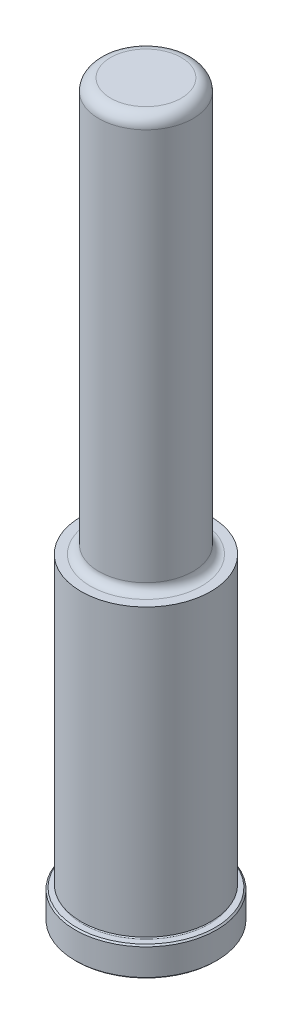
from build123d import *

# Parameters (mm, degrees)
CHAMFER1_SIZE = 0.381
FILLET7_R     = 3.175


with BuildPart() as part:
    # Sketch1 → Revolve1 (revolve)
    with BuildSketch(Plane(origin=(0, 0, 0), x_dir=(0, 0, -1), z_dir=(1, 0, 0)), mode=Mode.PRIVATE) as revolve1_sk:
        with BuildLine():
            Line((0, 0), (19.05, 0))
            Line((19.05, 0), (19.05, 7.9248))
            Line((19.05, 7.9248), (17.0688, 7.9248))
            ThreePointArc((17.0688, 7.9248), (16.6878, 8.3058), (17.0688, 8.6868))
            Line((17.0688, 8.6868), (17.4752, 8.6868))
            Line((17.4752, 8.6868), (17.4752, 85.725))
            Line((17.4752, 85.725), (14.9733, 85.725))
            ThreePointArc((14.9733, 85.725), (13.356853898, 86.394553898), (12.6873, 88.011))
            Line((12.6873, 88.011), (12.6873, 196.85))
            Line((12.6873, 196.85), (0, 196.85))
            Line((0, 196.85), (0, 0))
        make_face()
    revolve(revolve1_sk.sketch.rotate(Axis((0, 0, 0), (0, -1, 0)), 180), axis=Axis((0, 0, 0), (0, -1, 0)))

    # Chamfer1
    chamfer1_edges = [part.edges().sort_by_distance(p)[0] for p in [
        (0, 7.9248, -19.05),
        (0, 0, -19.05),
    ]]
    chamfer(chamfer1_edges, length=CHAMFER1_SIZE)

    # Fillet7
    fillet7_edges = [part.edges().sort_by_distance(p)[0] for p in [
        (0, 196.85, -12.6873),
    ]]
    fillet(fillet7_edges, radius=FILLET7_R)


solid = part.part
